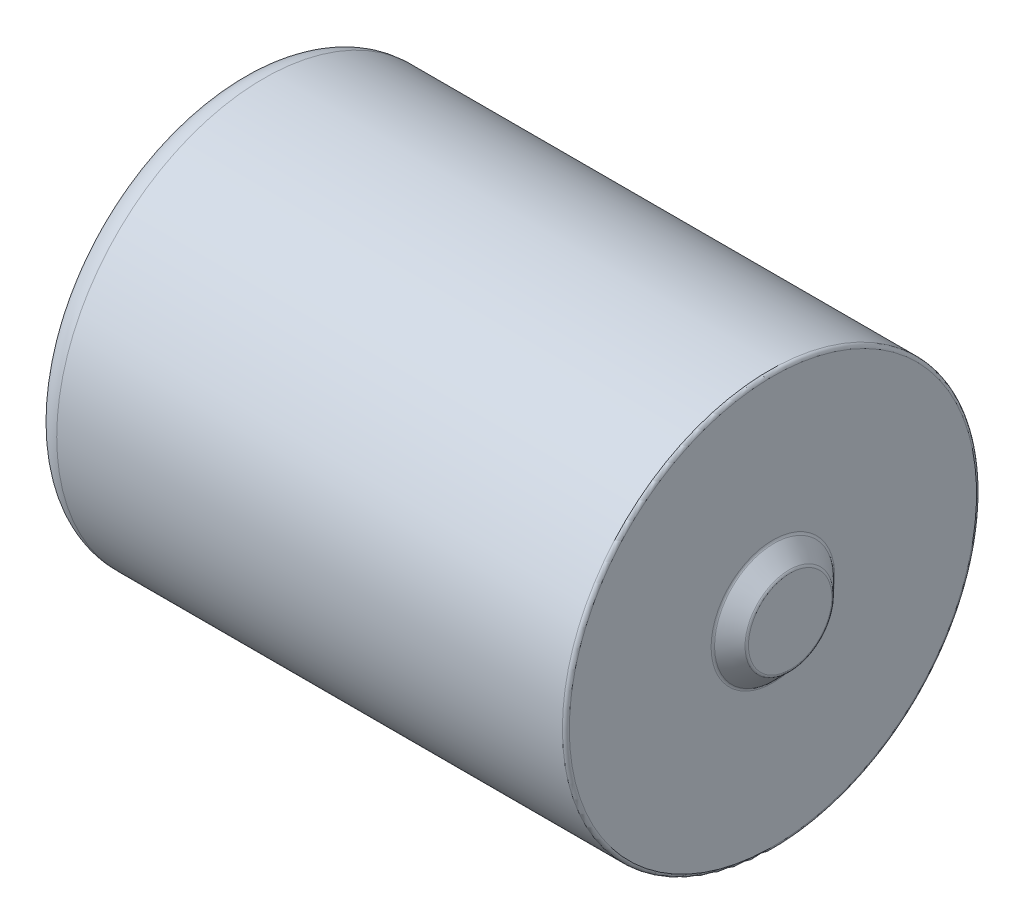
ISO-10303-21;
HEADER;
FILE_DESCRIPTION(('STEP AP214'),'2;1');
FILE_NAME('part.step','',(''),(''),'','','');
FILE_SCHEMA(('AUTOMOTIVE_DESIGN { 1 0 10303 214 1 1 1 1 }'));
ENDSEC;
DATA;
#1=APPLICATION_CONTEXT('core data for automotive mechanical design processes');
#2=APPLICATION_PROTOCOL_DEFINITION('international standard','automotive_design',2000,#1);
#3=PRODUCT_CONTEXT('',#1,'mechanical');
#4=PRODUCT('Part','Part','',(#3));
#5=PRODUCT_RELATED_PRODUCT_CATEGORY('part','',(#4));
#6=PRODUCT_DEFINITION_FORMATION('','',#4);
#7=PRODUCT_DEFINITION_CONTEXT('part definition',#1,'design');
#8=PRODUCT_DEFINITION('design','',#6,#7);
#9=PRODUCT_DEFINITION_SHAPE('','',#8);
#10=(LENGTH_UNIT() NAMED_UNIT(*) SI_UNIT(.MILLI.,.METRE.));
#11=(NAMED_UNIT(*) PLANE_ANGLE_UNIT() SI_UNIT($,.RADIAN.));
#12=(NAMED_UNIT(*) SI_UNIT($,.STERADIAN.) SOLID_ANGLE_UNIT());
#13=UNCERTAINTY_MEASURE_WITH_UNIT(LENGTH_MEASURE(1.E-05),#10,'distance_accuracy_value','');
#14=(GEOMETRIC_REPRESENTATION_CONTEXT(3) GLOBAL_UNCERTAINTY_ASSIGNED_CONTEXT((#13)) GLOBAL_UNIT_ASSIGNED_CONTEXT((#10,
#11,#12)) REPRESENTATION_CONTEXT('',''));
#15=CARTESIAN_POINT('',(0.,0.,0.));
#16=DIRECTION('',(0.,0.,1.));
#17=DIRECTION('',(1.,0.,0.));
#18=AXIS2_PLACEMENT_3D('',#15,#16,#17);
#19=CARTESIAN_POINT('',(0.,0.,0.));
#20=DIRECTION('',(-1.,0.,0.));
#21=DIRECTION('',(0.,0.,1.));
#22=AXIS2_PLACEMENT_3D('',#19,#20,#21);
#23=CYLINDRICAL_SURFACE('',#22,2.75);
#24=CARTESIAN_POINT('',(3.32679442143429,0.,0.));
#25=DIRECTION('',(1.,0.,0.));
#26=DIRECTION('',(0.,0.,-1.));
#27=AXIS2_PLACEMENT_3D('',#24,#25,#26);
#28=CIRCLE('',#27,2.75);
#29=CARTESIAN_POINT('',(3.32679442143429,0.,-2.75));
#30=VERTEX_POINT('',#29);
#31=EDGE_CURVE('E47',#30,#30,#28,.F.);
#32=ORIENTED_EDGE('',*,*,#31,.T.);
#33=EDGE_LOOP('',(#32));
#34=FACE_BOUND('',#33,.T.);
#35=CARTESIAN_POINT('',(3.62679442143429,0.,0.));
#36=DIRECTION('',(-1.,0.,0.));
#37=DIRECTION('',(0.,0.,1.));
#38=AXIS2_PLACEMENT_3D('',#35,#36,#37);
#39=CIRCLE('',#38,2.75);
#40=CARTESIAN_POINT('',(3.62679442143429,0.,2.75));
#41=VERTEX_POINT('',#40);
#42=EDGE_CURVE('E88',#41,#41,#39,.T.);
#43=ORIENTED_EDGE('',*,*,#42,.F.);
#44=EDGE_LOOP('',(#43));
#45=FACE_BOUND('',#44,.T.);
#46=ADVANCED_FACE('F33',(#34,#45),#23,.F.);
#47=CARTESIAN_POINT('',(3.12679442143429,2.75,0.));
#48=DIRECTION('',(1.,0.,0.));
#49=DIRECTION('',(0.,0.,-1.));
#50=AXIS2_PLACEMENT_3D('',#47,#48,#49);
#51=PLANE('',#50);
#52=CARTESIAN_POINT('',(3.12679442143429,0.,0.));
#53=DIRECTION('',(1.,0.,0.));
#54=DIRECTION('',(0.,0.,-1.));
#55=AXIS2_PLACEMENT_3D('',#52,#53,#54);
#56=CIRCLE('',#55,3.05);
#57=CARTESIAN_POINT('',(3.12679442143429,0.,-3.05));
#58=VERTEX_POINT('',#57);
#59=EDGE_CURVE('E58',#58,#58,#56,.F.);
#60=ORIENTED_EDGE('',*,*,#59,.T.);
#61=EDGE_LOOP('',(#60));
#62=FACE_BOUND('',#61,.T.);
#63=CARTESIAN_POINT('',(3.12679442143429,0.,0.));
#64=DIRECTION('',(1.,0.,0.));
#65=DIRECTION('',(0.,0.,-1.));
#66=AXIS2_PLACEMENT_3D('',#63,#64,#65);
#67=CIRCLE('',#66,2.95);
#68=CARTESIAN_POINT('',(3.12679442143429,0.,-2.95));
#69=VERTEX_POINT('',#68);
#70=EDGE_CURVE('E61',#69,#69,#67,.T.);
#71=ORIENTED_EDGE('',*,*,#70,.T.);
#72=EDGE_LOOP('',(#71));
#73=FACE_BOUND('',#72,.T.);
#74=ADVANCED_FACE('F95',(#62,#73),#51,.F.);
#75=CARTESIAN_POINT('',(0.,0.,0.));
#76=DIRECTION('',(-1.,0.,0.));
#77=DIRECTION('',(0.,0.,1.));
#78=AXIS2_PLACEMENT_3D('',#75,#76,#77);
#79=CYLINDRICAL_SURFACE('',#78,3.25);
#80=CARTESIAN_POINT('',(3.32679442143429,0.,0.));
#81=DIRECTION('',(1.,0.,0.));
#82=DIRECTION('',(0.,0.,-1.));
#83=AXIS2_PLACEMENT_3D('',#80,#81,#82);
#84=CIRCLE('',#83,3.25);
#85=CARTESIAN_POINT('',(3.32679442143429,0.,-3.25));
#86=VERTEX_POINT('',#85);
#87=EDGE_CURVE('E52',#86,#86,#84,.T.);
#88=ORIENTED_EDGE('',*,*,#87,.T.);
#89=EDGE_LOOP('',(#88));
#90=FACE_BOUND('',#89,.T.);
#91=CARTESIAN_POINT('',(3.92679442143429,0.,0.));
#92=DIRECTION('',(1.,0.,0.));
#93=DIRECTION('',(0.,0.,-1.));
#94=AXIS2_PLACEMENT_3D('',#91,#92,#93);
#95=CIRCLE('',#94,3.25);
#96=CARTESIAN_POINT('',(3.92679442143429,0.,-3.25));
#97=VERTEX_POINT('',#96);
#98=EDGE_CURVE('E55',#97,#97,#95,.F.);
#99=ORIENTED_EDGE('',*,*,#98,.T.);
#100=EDGE_LOOP('',(#99));
#101=FACE_BOUND('',#100,.T.);
#102=ADVANCED_FACE('F100',(#90,#101),#79,.T.);
#103=CARTESIAN_POINT('',(4.12679442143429,3.25,0.));
#104=DIRECTION('',(1.,0.,0.));
#105=DIRECTION('',(0.,0.,-1.));
#106=AXIS2_PLACEMENT_3D('',#103,#104,#105);
#107=PLANE('',#106);
#108=CARTESIAN_POINT('',(4.12679442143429,0.,0.));
#109=DIRECTION('',(1.,0.,0.));
#110=DIRECTION('',(0.,0.,-1.));
#111=AXIS2_PLACEMENT_3D('',#108,#109,#110);
#112=CIRCLE('',#111,3.45);
#113=CARTESIAN_POINT('',(4.12679442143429,0.,-3.45));
#114=VERTEX_POINT('',#113);
#115=EDGE_CURVE('E43',#114,#114,#112,.T.);
#116=ORIENTED_EDGE('',*,*,#115,.T.);
#117=EDGE_LOOP('',(#116));
#118=FACE_BOUND('',#117,.T.);
#119=CARTESIAN_POINT('',(4.12679442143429,0.,0.));
#120=DIRECTION('',(-1.,0.,0.));
#121=DIRECTION('',(0.,0.,1.));
#122=AXIS2_PLACEMENT_3D('',#119,#120,#121);
#123=CIRCLE('',#122,10.5);
#124=CARTESIAN_POINT('',(4.12679442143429,0.,10.5));
#125=VERTEX_POINT('',#124);
#126=EDGE_CURVE('E76',#125,#125,#123,.T.);
#127=ORIENTED_EDGE('',*,*,#126,.T.);
#128=EDGE_LOOP('',(#127));
#129=FACE_BOUND('',#128,.T.);
#130=ADVANCED_FACE('F158',(#118,#129),#107,.F.);
#131=CARTESIAN_POINT('',(5.62679442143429,0.,0.));
#132=DIRECTION('',(-1.,0.,0.));
#133=DIRECTION('',(0.,0.,1.));
#134=AXIS2_PLACEMENT_3D('',#131,#132,#133);
#135=TOROIDAL_SURFACE('',#134,10.5,1.5);
#136=ORIENTED_EDGE('',*,*,#126,.F.);
#137=EDGE_LOOP('',(#136));
#138=FACE_BOUND('',#137,.T.);
#139=CARTESIAN_POINT('',(5.62679442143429,0.,0.));
#140=DIRECTION('',(-1.,0.,0.));
#141=DIRECTION('',(0.,0.,1.));
#142=AXIS2_PLACEMENT_3D('',#139,#140,#141);
#143=CIRCLE('',#142,12.);
#144=CARTESIAN_POINT('',(5.62679442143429,0.,12.));
#145=VERTEX_POINT('',#144);
#146=EDGE_CURVE('E79',#145,#145,#143,.T.);
#147=ORIENTED_EDGE('',*,*,#146,.T.);
#148=EDGE_LOOP('',(#147));
#149=FACE_BOUND('',#148,.T.);
#150=ADVANCED_FACE('F155',(#138,#149),#135,.T.);
#151=CARTESIAN_POINT('',(0.,0.,0.));
#152=DIRECTION('',(-1.,0.,0.));
#153=DIRECTION('',(0.,0.,1.));
#154=AXIS2_PLACEMENT_3D('',#151,#152,#153);
#155=CYLINDRICAL_SURFACE('',#154,12.);
#156=CARTESIAN_POINT('',(34.9267944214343,0.,0.));
#157=DIRECTION('',(-1.,0.,0.));
#158=DIRECTION('',(0.,0.,1.));
#159=AXIS2_PLACEMENT_3D('',#156,#157,#158);
#160=CIRCLE('',#159,12.);
#161=CARTESIAN_POINT('',(34.9267944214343,0.,12.));
#162=VERTEX_POINT('',#161);
#163=EDGE_CURVE('E39',#162,#162,#160,.T.);
#164=ORIENTED_EDGE('',*,*,#163,.T.);
#165=EDGE_LOOP('',(#164));
#166=FACE_BOUND('',#165,.T.);
#167=ORIENTED_EDGE('',*,*,#146,.F.);
#168=EDGE_LOOP('',(#167));
#169=FACE_BOUND('',#168,.T.);
#170=ADVANCED_FACE('F152',(#166,#169),#155,.T.);
#171=CARTESIAN_POINT('',(35.1267944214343,12.,0.));
#172=DIRECTION('',(-1.,0.,0.));
#173=DIRECTION('',(0.,0.,1.));
#174=AXIS2_PLACEMENT_3D('',#171,#172,#173);
#175=PLANE('',#174);
#176=CARTESIAN_POINT('',(35.1267944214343,0.,0.));
#177=DIRECTION('',(-1.,0.,0.));
#178=DIRECTION('',(0.,0.,1.));
#179=AXIS2_PLACEMENT_3D('',#176,#177,#178);
#180=CIRCLE('',#179,11.8);
#181=CARTESIAN_POINT('',(35.1267944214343,0.,11.8));
#182=VERTEX_POINT('',#181);
#183=EDGE_CURVE('E10',#182,#182,#180,.F.);
#184=ORIENTED_EDGE('',*,*,#183,.T.);
#185=EDGE_LOOP('',(#184));
#186=FACE_BOUND('',#185,.T.);
#187=CARTESIAN_POINT('',(35.1267944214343,0.,0.));
#188=DIRECTION('',(-1.,0.,0.));
#189=DIRECTION('',(0.,0.,1.));
#190=AXIS2_PLACEMENT_3D('',#187,#188,#189);
#191=CIRCLE('',#190,3.58284271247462);
#192=CARTESIAN_POINT('',(35.1267944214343,0.,3.58284271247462));
#193=VERTEX_POINT('',#192);
#194=EDGE_CURVE('E73',#193,#193,#191,.T.);
#195=ORIENTED_EDGE('',*,*,#194,.T.);
#196=EDGE_LOOP('',(#195));
#197=FACE_BOUND('',#196,.T.);
#198=ADVANCED_FACE('F148',(#186,#197),#175,.F.);
#199=CARTESIAN_POINT('',(36.1267944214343,0.,0.));
#200=DIRECTION('',(-1.,0.,0.));
#201=DIRECTION('',(0.,0.,1.));
#202=AXIS2_PLACEMENT_3D('',#199,#200,#201);
#203=CONICAL_SURFACE('',#202,2.5,0.785398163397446);
#204=CARTESIAN_POINT('',(35.185373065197,0.,0.));
#205=DIRECTION('',(-1.,0.,0.));
#206=DIRECTION('',(0.,0.,1.));
#207=AXIS2_PLACEMENT_3D('',#204,#205,#206);
#208=CIRCLE('',#207,3.44142135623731);
#209=CARTESIAN_POINT('',(35.185373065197,0.,3.44142135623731));
#210=VERTEX_POINT('',#209);
#211=EDGE_CURVE('E67',#210,#210,#208,.F.);
#212=ORIENTED_EDGE('',*,*,#211,.T.);
#213=EDGE_LOOP('',(#212));
#214=FACE_BOUND('',#213,.T.);
#215=CARTESIAN_POINT('',(36.0682157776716,0.,0.));
#216=DIRECTION('',(1.,0.,0.));
#217=DIRECTION('',(0.,0.,-1.));
#218=AXIS2_PLACEMENT_3D('',#215,#216,#217);
#219=CIRCLE('',#218,2.55857864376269);
#220=CARTESIAN_POINT('',(36.0682157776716,0.,-2.55857864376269));
#221=VERTEX_POINT('',#220);
#222=EDGE_CURVE('E70',#221,#221,#219,.F.);
#223=ORIENTED_EDGE('',*,*,#222,.T.);
#224=EDGE_LOOP('',(#223));
#225=FACE_BOUND('',#224,.T.);
#226=ADVANCED_FACE('F144',(#214,#225),#203,.T.);
#227=CARTESIAN_POINT('',(36.1267944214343,2.5,0.));
#228=DIRECTION('',(-1.,0.,0.));
#229=DIRECTION('',(0.,0.,1.));
#230=AXIS2_PLACEMENT_3D('',#227,#228,#229);
#231=PLANE('',#230);
#232=CARTESIAN_POINT('',(36.1267944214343,0.,0.));
#233=DIRECTION('',(-1.,0.,0.));
#234=DIRECTION('',(0.,0.,1.));
#235=AXIS2_PLACEMENT_3D('',#232,#233,#234);
#236=CIRCLE('',#235,2.41715728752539);
#237=CARTESIAN_POINT('',(36.1267944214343,0.,2.41715728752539));
#238=VERTEX_POINT('',#237);
#239=EDGE_CURVE('E64',#238,#238,#236,.F.);
#240=ORIENTED_EDGE('',*,*,#239,.T.);
#241=EDGE_LOOP('',(#240));
#242=FACE_BOUND('',#241,.T.);
#243=ADVANCED_FACE('F140',(#242),#231,.F.);
#244=CARTESIAN_POINT('',(21.6466304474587,1.,0.));
#245=DIRECTION('',(1.,0.,0.));
#246=DIRECTION('',(0.,0.,-1.));
#247=AXIS2_PLACEMENT_3D('',#244,#245,#246);
#248=PLANE('',#247);
#249=CARTESIAN_POINT('',(21.6466304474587,0.,0.));
#250=DIRECTION('',(-1.,0.,0.));
#251=DIRECTION('',(0.,0.,1.));
#252=AXIS2_PLACEMENT_3D('',#249,#250,#251);
#253=CIRCLE('',#252,1.);
#254=CARTESIAN_POINT('',(21.6466304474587,0.,1.));
#255=VERTEX_POINT('',#254);
#256=EDGE_CURVE('E82',#255,#255,#253,.T.);
#257=ORIENTED_EDGE('',*,*,#256,.T.);
#258=EDGE_LOOP('',(#257));
#259=FACE_BOUND('',#258,.T.);
#260=ADVANCED_FACE('F136',(#259),#248,.F.);
#261=CARTESIAN_POINT('',(0.,0.,0.));
#262=DIRECTION('',(-1.,0.,0.));
#263=DIRECTION('',(0.,0.,1.));
#264=AXIS2_PLACEMENT_3D('',#261,#262,#263);
#265=CYLINDRICAL_SURFACE('',#264,1.);
#266=ORIENTED_EDGE('',*,*,#256,.F.);
#267=EDGE_LOOP('',(#266));
#268=FACE_BOUND('',#267,.T.);
#269=CARTESIAN_POINT('',(3.62679442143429,0.,0.));
#270=DIRECTION('',(-1.,0.,0.));
#271=DIRECTION('',(0.,0.,1.));
#272=AXIS2_PLACEMENT_3D('',#269,#270,#271);
#273=CIRCLE('',#272,1.);
#274=CARTESIAN_POINT('',(3.62679442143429,0.,1.));
#275=VERTEX_POINT('',#274);
#276=EDGE_CURVE('E85',#275,#275,#273,.T.);
#277=ORIENTED_EDGE('',*,*,#276,.T.);
#278=EDGE_LOOP('',(#277));
#279=FACE_BOUND('',#278,.T.);
#280=ADVANCED_FACE('F132',(#268,#279),#265,.F.);
#281=CARTESIAN_POINT('',(3.62679442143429,1.,0.));
#282=DIRECTION('',(1.,0.,0.));
#283=DIRECTION('',(0.,0.,-1.));
#284=AXIS2_PLACEMENT_3D('',#281,#282,#283);
#285=PLANE('',#284);
#286=ORIENTED_EDGE('',*,*,#276,.F.);
#287=EDGE_LOOP('',(#286));
#288=FACE_BOUND('',#287,.T.);
#289=ORIENTED_EDGE('',*,*,#42,.T.);
#290=EDGE_LOOP('',(#289));
#291=FACE_BOUND('',#290,.T.);
#292=ADVANCED_FACE('F92',(#288,#291),#285,.F.);
#293=CARTESIAN_POINT('',(35.3267944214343,0.,0.));
#294=DIRECTION('',(-1.,0.,0.));
#295=DIRECTION('',(0.,0.,1.));
#296=AXIS2_PLACEMENT_3D('',#293,#294,#295);
#297=TOROIDAL_SURFACE('',#296,3.58284271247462,0.2);
#298=ORIENTED_EDGE('',*,*,#211,.F.);
#299=EDGE_LOOP('',(#298));
#300=FACE_BOUND('',#299,.T.);
#301=ORIENTED_EDGE('',*,*,#194,.F.);
#302=EDGE_LOOP('',(#301));
#303=FACE_BOUND('',#302,.T.);
#304=ADVANCED_FACE('F125',(#300,#303),#297,.F.);
#305=CARTESIAN_POINT('',(35.9267944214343,0.,0.));
#306=DIRECTION('',(-1.,0.,0.));
#307=DIRECTION('',(0.,0.,1.));
#308=AXIS2_PLACEMENT_3D('',#305,#306,#307);
#309=TOROIDAL_SURFACE('',#308,2.41715728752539,0.2);
#310=ORIENTED_EDGE('',*,*,#239,.F.);
#311=EDGE_LOOP('',(#310));
#312=FACE_BOUND('',#311,.T.);
#313=ORIENTED_EDGE('',*,*,#222,.F.);
#314=EDGE_LOOP('',(#313));
#315=FACE_BOUND('',#314,.T.);
#316=ADVANCED_FACE('F117',(#312,#315),#309,.T.);
#317=CARTESIAN_POINT('',(3.32679442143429,0.,0.));
#318=DIRECTION('',(1.,0.,0.));
#319=DIRECTION('',(0.,0.,-1.));
#320=AXIS2_PLACEMENT_3D('',#317,#318,#319);
#321=TOROIDAL_SURFACE('',#320,3.05,0.2);
#322=ORIENTED_EDGE('',*,*,#87,.F.);
#323=EDGE_LOOP('',(#322));
#324=FACE_BOUND('',#323,.T.);
#325=ORIENTED_EDGE('',*,*,#59,.F.);
#326=EDGE_LOOP('',(#325));
#327=FACE_BOUND('',#326,.T.);
#328=ADVANCED_FACE('F107',(#324,#327),#321,.T.);
#329=CARTESIAN_POINT('',(3.32679442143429,0.,0.));
#330=DIRECTION('',(1.,0.,0.));
#331=DIRECTION('',(0.,0.,-1.));
#332=AXIS2_PLACEMENT_3D('',#329,#330,#331);
#333=TOROIDAL_SURFACE('',#332,2.95,0.2);
#334=ORIENTED_EDGE('',*,*,#70,.F.);
#335=EDGE_LOOP('',(#334));
#336=FACE_BOUND('',#335,.T.);
#337=ORIENTED_EDGE('',*,*,#31,.F.);
#338=EDGE_LOOP('',(#337));
#339=FACE_BOUND('',#338,.T.);
#340=ADVANCED_FACE('F104',(#336,#339),#333,.T.);
#341=CARTESIAN_POINT('',(3.92679442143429,0.,0.));
#342=DIRECTION('',(1.,0.,0.));
#343=DIRECTION('',(0.,0.,-1.));
#344=AXIS2_PLACEMENT_3D('',#341,#342,#343);
#345=TOROIDAL_SURFACE('',#344,3.45,0.2);
#346=ORIENTED_EDGE('',*,*,#115,.F.);
#347=EDGE_LOOP('',(#346));
#348=FACE_BOUND('',#347,.T.);
#349=ORIENTED_EDGE('',*,*,#98,.F.);
#350=EDGE_LOOP('',(#349));
#351=FACE_BOUND('',#350,.T.);
#352=ADVANCED_FACE('F106',(#348,#351),#345,.F.);
#353=CARTESIAN_POINT('',(34.9267944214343,0.,0.));
#354=DIRECTION('',(-1.,0.,0.));
#355=DIRECTION('',(0.,0.,1.));
#356=AXIS2_PLACEMENT_3D('',#353,#354,#355);
#357=TOROIDAL_SURFACE('',#356,11.8,0.2);
#358=ORIENTED_EDGE('',*,*,#183,.F.);
#359=EDGE_LOOP('',(#358));
#360=FACE_BOUND('',#359,.T.);
#361=ORIENTED_EDGE('',*,*,#163,.F.);
#362=EDGE_LOOP('',(#361));
#363=FACE_BOUND('',#362,.T.);
#364=ADVANCED_FACE('F114',(#360,#363),#357,.T.);
#365=CLOSED_SHELL('',(#46,#74,#102,#130,#150,#170,#198,#226,#243,#260,#280,#292,#304,#316,#328,
#340,#352,#364));
#366=MANIFOLD_SOLID_BREP('B2',#365);
#367=ADVANCED_BREP_SHAPE_REPRESENTATION('',(#18,#366),#14);
#368=SHAPE_DEFINITION_REPRESENTATION(#9,#367);
ENDSEC;
END-ISO-10303-21;
